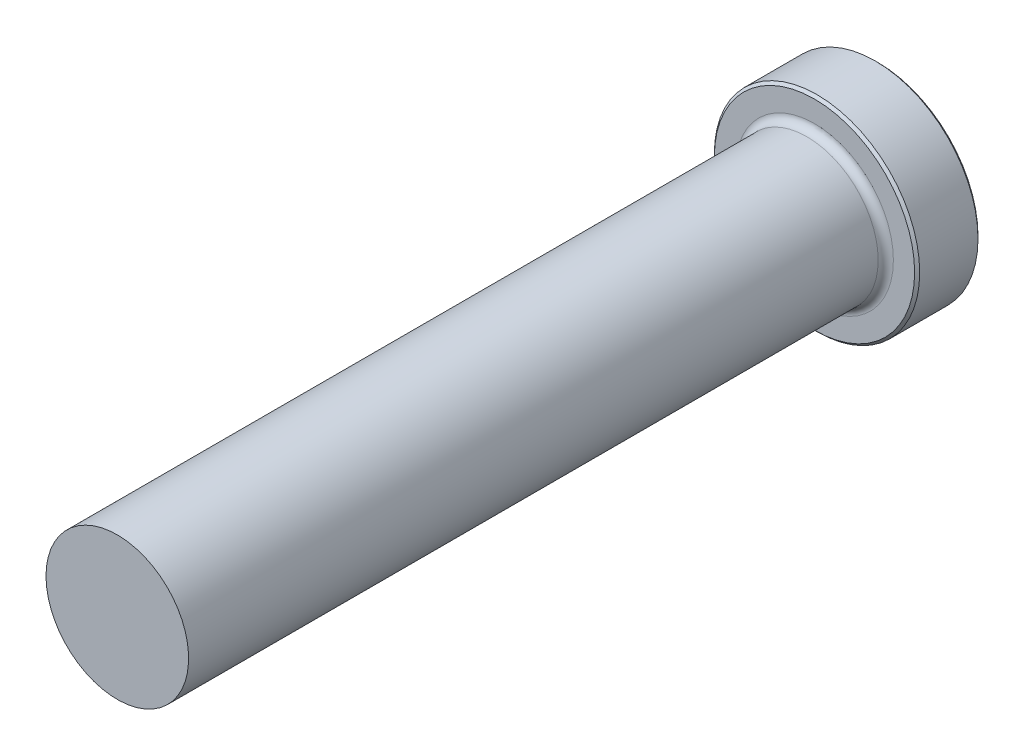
ISO-10303-21;
HEADER;
FILE_DESCRIPTION(('STEP AP214'),'2;1');
FILE_NAME('part.step','',(''),(''),'','','');
FILE_SCHEMA(('AUTOMOTIVE_DESIGN { 1 0 10303 214 1 1 1 1 }'));
ENDSEC;
DATA;
#1=APPLICATION_CONTEXT('core data for automotive mechanical design processes');
#2=APPLICATION_PROTOCOL_DEFINITION('international standard','automotive_design',2000,#1);
#3=PRODUCT_CONTEXT('',#1,'mechanical');
#4=PRODUCT('Part','Part','',(#3));
#5=PRODUCT_RELATED_PRODUCT_CATEGORY('part','',(#4));
#6=PRODUCT_DEFINITION_FORMATION('','',#4);
#7=PRODUCT_DEFINITION_CONTEXT('part definition',#1,'design');
#8=PRODUCT_DEFINITION('design','',#6,#7);
#9=PRODUCT_DEFINITION_SHAPE('','',#8);
#10=(LENGTH_UNIT() NAMED_UNIT(*) SI_UNIT(.MILLI.,.METRE.));
#11=(NAMED_UNIT(*) PLANE_ANGLE_UNIT() SI_UNIT($,.RADIAN.));
#12=(NAMED_UNIT(*) SI_UNIT($,.STERADIAN.) SOLID_ANGLE_UNIT());
#13=UNCERTAINTY_MEASURE_WITH_UNIT(LENGTH_MEASURE(1.E-05),#10,'distance_accuracy_value','');
#14=(GEOMETRIC_REPRESENTATION_CONTEXT(3) GLOBAL_UNCERTAINTY_ASSIGNED_CONTEXT((#13)) GLOBAL_UNIT_ASSIGNED_CONTEXT((#10,
#11,#12)) REPRESENTATION_CONTEXT('',''));
#15=CARTESIAN_POINT('',(0.,0.,0.));
#16=DIRECTION('',(0.,0.,1.));
#17=DIRECTION('',(1.,0.,0.));
#18=AXIS2_PLACEMENT_3D('',#15,#16,#17);
#19=CARTESIAN_POINT('',(0.,0.,0.));
#20=DIRECTION('',(0.,0.,-1.));
#21=DIRECTION('',(-1.,0.,0.));
#22=AXIS2_PLACEMENT_3D('',#19,#20,#21);
#23=PLANE('',#22);
#24=CARTESIAN_POINT('',(0.,0.,0.));
#25=DIRECTION('',(0.,0.,-1.));
#26=DIRECTION('',(-1.,0.,0.));
#27=AXIS2_PLACEMENT_3D('',#24,#25,#26);
#28=CIRCLE('',#27,10.033);
#29=CARTESIAN_POINT('',(-10.033,0.,0.));
#30=VERTEX_POINT('',#29);
#31=EDGE_CURVE('E50',#30,#30,#28,.T.);
#32=ORIENTED_EDGE('',*,*,#31,.T.);
#33=EDGE_LOOP('',(#32));
#34=FACE_BOUND('',#33,.T.);
#35=ADVANCED_FACE('F35',(#34),#23,.T.);
#36=CARTESIAN_POINT('',(0.,0.,0.));
#37=DIRECTION('',(0.,0.,-1.));
#38=DIRECTION('',(-1.,0.,0.));
#39=AXIS2_PLACEMENT_3D('',#36,#37,#38);
#40=CYLINDRICAL_SURFACE('',#39,10.287);
#41=CARTESIAN_POINT('',(0.,0.,0.254000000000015));
#42=DIRECTION('',(0.,0.,-1.));
#43=DIRECTION('',(-1.,0.,0.));
#44=AXIS2_PLACEMENT_3D('',#41,#42,#43);
#45=CIRCLE('',#44,10.287);
#46=CARTESIAN_POINT('',(-10.287,0.,0.254000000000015));
#47=VERTEX_POINT('',#46);
#48=EDGE_CURVE('E42',#47,#47,#45,.F.);
#49=ORIENTED_EDGE('',*,*,#48,.T.);
#50=EDGE_LOOP('',(#49));
#51=FACE_BOUND('',#50,.T.);
#52=CARTESIAN_POINT('',(0.,0.,6.096));
#53=DIRECTION('',(0.,0.,1.));
#54=DIRECTION('',(1.,0.,0.));
#55=AXIS2_PLACEMENT_3D('',#52,#53,#54);
#56=CIRCLE('',#55,10.287);
#57=CARTESIAN_POINT('',(10.287,0.,6.096));
#58=VERTEX_POINT('',#57);
#59=EDGE_CURVE('E46',#58,#58,#56,.F.);
#60=ORIENTED_EDGE('',*,*,#59,.T.);
#61=EDGE_LOOP('',(#60));
#62=FACE_BOUND('',#61,.T.);
#63=ADVANCED_FACE('F82',(#51,#62),#40,.T.);
#64=CARTESIAN_POINT('',(0.,10.287,6.35));
#65=DIRECTION('',(0.,0.,1.));
#66=DIRECTION('',(1.,0.,0.));
#67=AXIS2_PLACEMENT_3D('',#64,#65,#66);
#68=PLANE('',#67);
#69=CARTESIAN_POINT('',(0.,0.,6.35));
#70=DIRECTION('',(0.,0.,1.));
#71=DIRECTION('',(1.,0.,0.));
#72=AXIS2_PLACEMENT_3D('',#69,#70,#71);
#73=CIRCLE('',#72,10.033);
#74=CARTESIAN_POINT('',(10.033,0.,6.35));
#75=VERTEX_POINT('',#74);
#76=EDGE_CURVE('E10',#75,#75,#73,.T.);
#77=ORIENTED_EDGE('',*,*,#76,.T.);
#78=EDGE_LOOP('',(#77));
#79=FACE_BOUND('',#78,.T.);
#80=CARTESIAN_POINT('',(0.,0.,6.35));
#81=DIRECTION('',(0.,0.,1.));
#82=DIRECTION('',(1.,0.,0.));
#83=AXIS2_PLACEMENT_3D('',#80,#81,#82);
#84=CIRCLE('',#83,7.90574999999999);
#85=CARTESIAN_POINT('',(7.90574999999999,0.,6.35));
#86=VERTEX_POINT('',#85);
#87=EDGE_CURVE('E58',#86,#86,#84,.F.);
#88=ORIENTED_EDGE('',*,*,#87,.T.);
#89=EDGE_LOOP('',(#88));
#90=FACE_BOUND('',#89,.T.);
#91=ADVANCED_FACE('F78',(#79,#90),#68,.T.);
#92=CARTESIAN_POINT('',(0.,0.,0.));
#93=DIRECTION('',(0.,0.,-1.));
#94=DIRECTION('',(-1.,0.,0.));
#95=AXIS2_PLACEMENT_3D('',#92,#93,#94);
#96=CYLINDRICAL_SURFACE('',#95,7.14374999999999);
#97=CARTESIAN_POINT('',(0.,0.,7.112));
#98=DIRECTION('',(0.,0.,1.));
#99=DIRECTION('',(1.,0.,0.));
#100=AXIS2_PLACEMENT_3D('',#97,#98,#99);
#101=CIRCLE('',#100,7.14374999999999);
#102=CARTESIAN_POINT('',(7.14374999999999,0.,7.112));
#103=VERTEX_POINT('',#102);
#104=EDGE_CURVE('E55',#103,#103,#101,.T.);
#105=ORIENTED_EDGE('',*,*,#104,.T.);
#106=EDGE_LOOP('',(#105));
#107=FACE_BOUND('',#106,.T.);
#108=CARTESIAN_POINT('',(0.,0.,76.2));
#109=DIRECTION('',(0.,0.,-1.));
#110=DIRECTION('',(-1.,0.,0.));
#111=AXIS2_PLACEMENT_3D('',#108,#109,#110);
#112=CIRCLE('',#111,7.14374999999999);
#113=CARTESIAN_POINT('',(-7.14374999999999,0.,76.2));
#114=VERTEX_POINT('',#113);
#115=EDGE_CURVE('E61',#114,#114,#112,.T.);
#116=ORIENTED_EDGE('',*,*,#115,.T.);
#117=EDGE_LOOP('',(#116));
#118=FACE_BOUND('',#117,.T.);
#119=ADVANCED_FACE('F65',(#107,#118),#96,.T.);
#120=CARTESIAN_POINT('',(0.,7.14374999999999,76.2));
#121=DIRECTION('',(0.,0.,1.));
#122=DIRECTION('',(1.,0.,0.));
#123=AXIS2_PLACEMENT_3D('',#120,#121,#122);
#124=PLANE('',#123);
#125=ORIENTED_EDGE('',*,*,#115,.F.);
#126=EDGE_LOOP('',(#125));
#127=FACE_BOUND('',#126,.T.);
#128=ADVANCED_FACE('F67',(#127),#124,.T.);
#129=CARTESIAN_POINT('',(0.,0.,7.112));
#130=DIRECTION('',(0.,0.,1.));
#131=DIRECTION('',(1.,0.,0.));
#132=AXIS2_PLACEMENT_3D('',#129,#130,#131);
#133=TOROIDAL_SURFACE('',#132,7.90574999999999,0.762);
#134=ORIENTED_EDGE('',*,*,#104,.F.);
#135=EDGE_LOOP('',(#134));
#136=FACE_BOUND('',#135,.T.);
#137=ORIENTED_EDGE('',*,*,#87,.F.);
#138=EDGE_LOOP('',(#137));
#139=FACE_BOUND('',#138,.T.);
#140=ADVANCED_FACE('F69',(#136,#139),#133,.F.);
#141=CARTESIAN_POINT('',(0.,0.,0.));
#142=DIRECTION('',(0.,0.,1.));
#143=DIRECTION('',(1.,0.,0.));
#144=AXIS2_PLACEMENT_3D('',#141,#142,#143);
#145=CONICAL_SURFACE('',#144,10.033,0.785398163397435);
#146=ORIENTED_EDGE('',*,*,#48,.F.);
#147=EDGE_LOOP('',(#146));
#148=FACE_BOUND('',#147,.T.);
#149=ORIENTED_EDGE('',*,*,#31,.F.);
#150=EDGE_LOOP('',(#149));
#151=FACE_BOUND('',#150,.T.);
#152=ADVANCED_FACE('F75',(#148,#151),#145,.T.);
#153=CARTESIAN_POINT('',(0.,0.,6.096));
#154=DIRECTION('',(0.,0.,-1.));
#155=DIRECTION('',(-1.,0.,0.));
#156=AXIS2_PLACEMENT_3D('',#153,#154,#155);
#157=CONICAL_SURFACE('',#156,10.287,0.785398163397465);
#158=ORIENTED_EDGE('',*,*,#76,.F.);
#159=EDGE_LOOP('',(#158));
#160=FACE_BOUND('',#159,.T.);
#161=ORIENTED_EDGE('',*,*,#59,.F.);
#162=EDGE_LOOP('',(#161));
#163=FACE_BOUND('',#162,.T.);
#164=ADVANCED_FACE('F37',(#160,#163),#157,.T.);
#165=CLOSED_SHELL('',(#35,#63,#91,#119,#128,#140,#152,#164));
#166=MANIFOLD_SOLID_BREP('B2',#165);
#167=ADVANCED_BREP_SHAPE_REPRESENTATION('',(#18,#166),#14);
#168=SHAPE_DEFINITION_REPRESENTATION(#9,#167);
ENDSEC;
END-ISO-10303-21;
